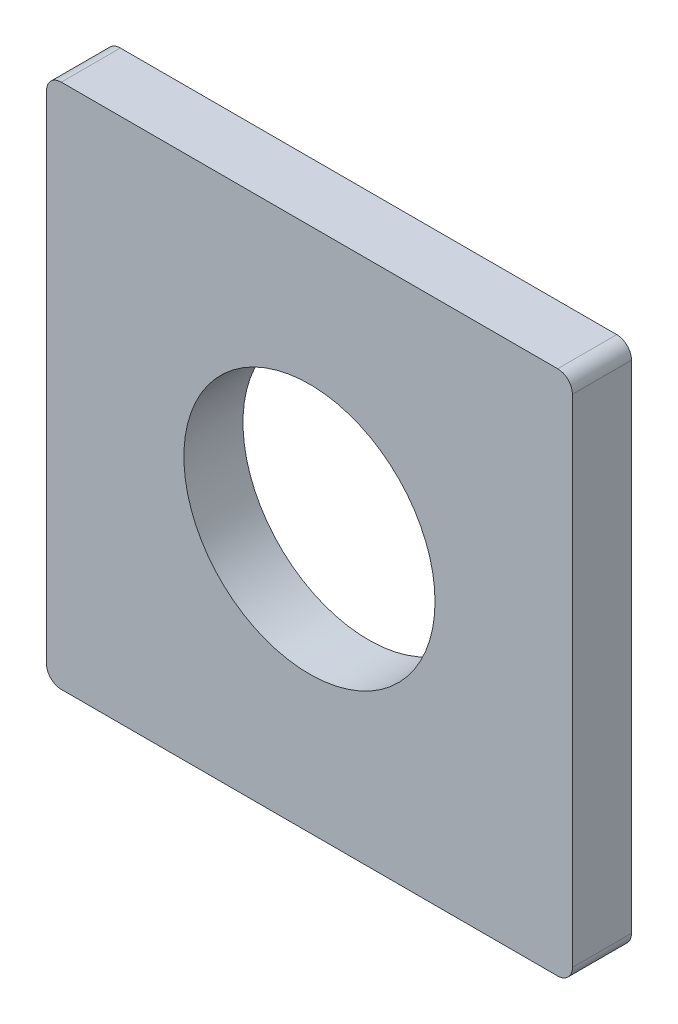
from build123d import *

# Parameters (mm, degrees)
SKETCH1_R           = 4.25
BOSS_EXTRUDE1_DEPTH = 2


with BuildPart() as part:
    # Sketch1 → Boss-Extrude1 (new body)
    with BuildSketch(Plane.XY):
        with BuildLine():
            Line((0.5, 0), (17.3, 0))
            ThreePointArc((17.3, 0), (17.653553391, 0.146446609), (17.8, 0.5))
            Line((17.8, 0.5), (17.8, 17.3))
            ThreePointArc((17.8, 17.3), (17.653553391, 17.653553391), (17.3, 17.8))
            Line((17.3, 17.8), (0.5, 17.8))
            ThreePointArc((0.5, 17.8), (0.146446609, 17.653553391), (0, 17.3))
            Line((0, 17.3), (0, 0.5))
            ThreePointArc((0, 0.5), (0.146446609, 0.146446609), (0.5, 0))
        make_face()
        with Locations((8.9, 8.9)):
            Circle(SKETCH1_R, mode=Mode.SUBTRACT)
    extrude(amount=BOSS_EXTRUDE1_DEPTH)


solid = part.part
